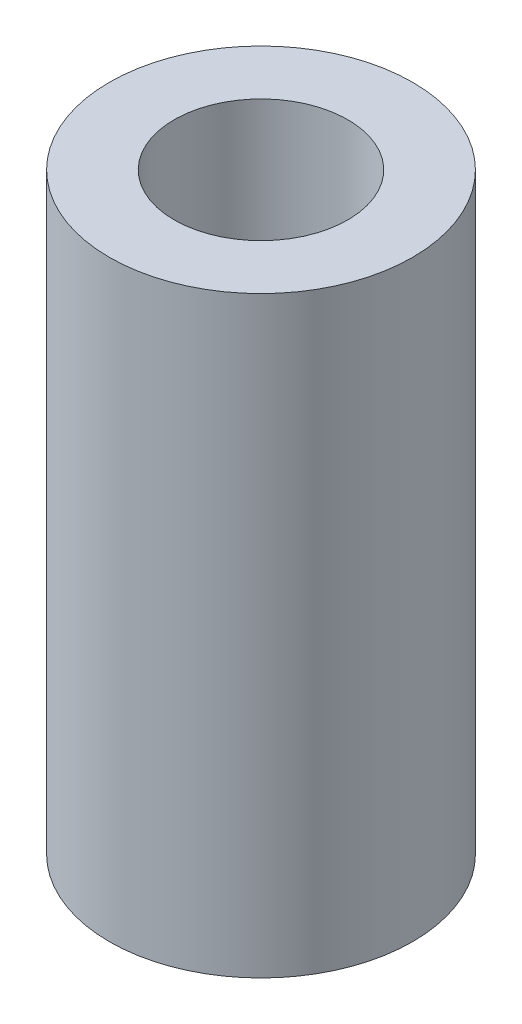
from build123d import *

# Parameters (mm, degrees)
SKETCH1_R            = 2.794
BOSS_EXTRUDE1_DEPTH  = 10.922
M3_CLEARANCE_HOLE1_D = 3.2


with BuildPart() as part:
    # Sketch1 → Boss-Extrude1 (new body)
    with BuildSketch(Plane(origin=(0, 0, 0), x_dir=(1, 0, 0), z_dir=(0, 1, 0))):
        with Locations(Location((0, 0, 0), (0, 0, 270))):
            Circle(SKETCH1_R)
    extrude(amount=BOSS_EXTRUDE1_DEPTH)

    # M3 Clearance Hole1 (through all)
    with Locations(Plane(origin=(0, 10.922, 0), x_dir=(-1, 0, 0), z_dir=(0, 1, 0))):
        with Locations((0, 0)):
            Hole(M3_CLEARANCE_HOLE1_D / 2)


solid = part.part
